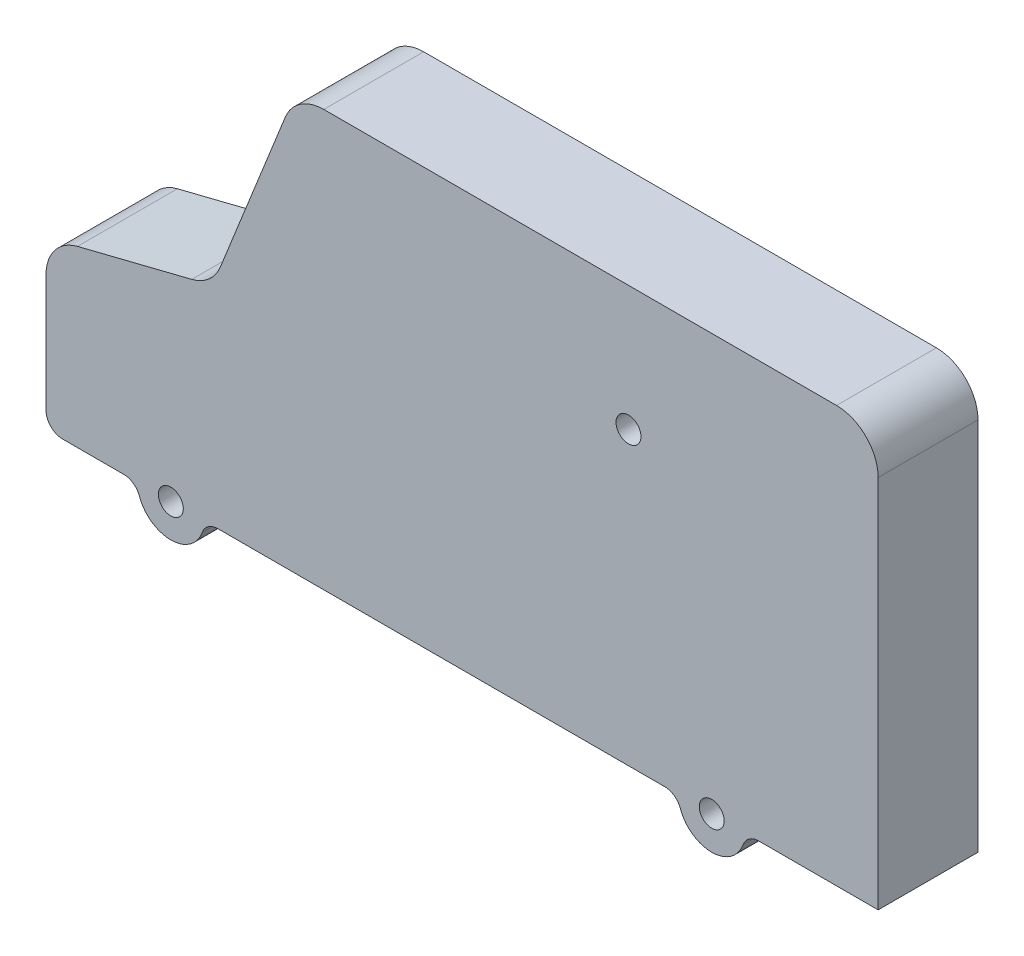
ISO-10303-21;
HEADER;
FILE_DESCRIPTION(('STEP AP214'),'2;1');
FILE_NAME('part.step','',(''),(''),'','','');
FILE_SCHEMA(('AUTOMOTIVE_DESIGN { 1 0 10303 214 1 1 1 1 }'));
ENDSEC;
DATA;
#1=APPLICATION_CONTEXT('core data for automotive mechanical design processes');
#2=APPLICATION_PROTOCOL_DEFINITION('international standard','automotive_design',2000,#1);
#3=PRODUCT_CONTEXT('',#1,'mechanical');
#4=PRODUCT('Part','Part','',(#3));
#5=PRODUCT_RELATED_PRODUCT_CATEGORY('part','',(#4));
#6=PRODUCT_DEFINITION_FORMATION('','',#4);
#7=PRODUCT_DEFINITION_CONTEXT('part definition',#1,'design');
#8=PRODUCT_DEFINITION('design','',#6,#7);
#9=PRODUCT_DEFINITION_SHAPE('','',#8);
#10=(LENGTH_UNIT() NAMED_UNIT(*) SI_UNIT(.MILLI.,.METRE.));
#11=(NAMED_UNIT(*) PLANE_ANGLE_UNIT() SI_UNIT($,.RADIAN.));
#12=(NAMED_UNIT(*) SI_UNIT($,.STERADIAN.) SOLID_ANGLE_UNIT());
#13=UNCERTAINTY_MEASURE_WITH_UNIT(LENGTH_MEASURE(1.E-05),#10,'distance_accuracy_value','');
#14=(GEOMETRIC_REPRESENTATION_CONTEXT(3) GLOBAL_UNCERTAINTY_ASSIGNED_CONTEXT((#13)) GLOBAL_UNIT_ASSIGNED_CONTEXT((#10,
#11,#12)) REPRESENTATION_CONTEXT('',''));
#15=CARTESIAN_POINT('',(0.,0.,0.));
#16=DIRECTION('',(0.,0.,1.));
#17=DIRECTION('',(1.,0.,0.));
#18=AXIS2_PLACEMENT_3D('',#15,#16,#17);
#19=CARTESIAN_POINT('',(33.3851648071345,45.,12.));
#20=DIRECTION('',(0.,0.,-1.));
#21=DIRECTION('',(-1.,0.,0.));
#22=AXIS2_PLACEMENT_3D('',#19,#20,#21);
#23=PLANE('',#22);
#24=CARTESIAN_POINT('',(80.,0.,12.));
#25=DIRECTION('',(0.,0.,1.));
#26=DIRECTION('',(1.,0.,0.));
#27=AXIS2_PLACEMENT_3D('',#24,#25,#26);
#28=CIRCLE('',#27,1.5);
#29=CARTESIAN_POINT('',(81.5,0.,12.));
#30=VERTEX_POINT('',#29);
#31=EDGE_CURVE('E421',#30,#30,#28,.T.);
#32=ORIENTED_EDGE('',*,*,#31,.F.);
#33=EDGE_LOOP('',(#32));
#34=FACE_BOUND('',#33,.T.);
#35=CARTESIAN_POINT('',(33.3851648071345,45.,12.));
#36=DIRECTION('',(0.,0.,1.));
#37=DIRECTION('',(-1.,0.,0.));
#38=AXIS2_PLACEMENT_3D('',#35,#36,#37);
#39=CIRCLE('',#38,5.);
#40=CARTESIAN_POINT('',(33.3851648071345,50.,12.));
#41=VERTEX_POINT('',#40);
#42=CARTESIAN_POINT('',(28.7427813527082,46.8569533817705,12.));
#43=VERTEX_POINT('',#42);
#44=EDGE_CURVE('E216',#41,#43,#39,.T.);
#45=ORIENTED_EDGE('',*,*,#44,.T.);
#46=DIRECTION('',(-0.371390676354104,-0.928476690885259,0.));
#47=VECTOR('',#46,1.);
#48=CARTESIAN_POINT('',(20.9494812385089,27.3737030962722,12.));
#49=LINE('',#48,#47);
#50=CARTESIAN_POINT('',(20.9494812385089,27.3737030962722,12.));
#51=VERTEX_POINT('',#50);
#52=EDGE_CURVE('E171',#43,#51,#49,.T.);
#53=ORIENTED_EDGE('',*,*,#52,.T.);
#54=CARTESIAN_POINT('',(16.3070977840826,29.2306564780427,12.));
#55=DIRECTION('',(0.,0.,-1.));
#56=DIRECTION('',(1.,0.,0.));
#57=AXIS2_PLACEMENT_3D('',#54,#55,#56);
#58=CIRCLE('',#57,5.);
#59=CARTESIAN_POINT('',(17.5197759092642,24.3799439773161,12.));
#60=VERTEX_POINT('',#59);
#61=EDGE_CURVE('E219',#51,#60,#58,.T.);
#62=ORIENTED_EDGE('',*,*,#61,.T.);
#63=DIRECTION('',(-0.970142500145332,-0.242535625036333,0.));
#64=VECTOR('',#63,1.);
#65=CARTESIAN_POINT('',(3.78732187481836,20.9468304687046,12.));
#66=LINE('',#65,#64);
#67=CARTESIAN_POINT('',(3.78732187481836,20.9468304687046,12.));
#68=VERTEX_POINT('',#67);
#69=EDGE_CURVE('E221',#60,#68,#66,.T.);
#70=ORIENTED_EDGE('',*,*,#69,.T.);
#71=CARTESIAN_POINT('',(5.,16.0961179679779,12.));
#72=DIRECTION('',(0.,0.,1.));
#73=DIRECTION('',(1.,0.,0.));
#74=AXIS2_PLACEMENT_3D('',#71,#72,#73);
#75=CIRCLE('',#74,5.);
#76=CARTESIAN_POINT('',(0.,16.0961179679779,12.));
#77=VERTEX_POINT('',#76);
#78=EDGE_CURVE('E223',#68,#77,#75,.T.);
#79=ORIENTED_EDGE('',*,*,#78,.T.);
#80=DIRECTION('',(0.,-1.,0.));
#81=VECTOR('',#80,1.);
#82=CARTESIAN_POINT('',(0.,2.00000000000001,12.));
#83=LINE('',#82,#81);
#84=CARTESIAN_POINT('',(0.,2.00000000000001,12.));
#85=VERTEX_POINT('',#84);
#86=EDGE_CURVE('E225',#77,#85,#83,.T.);
#87=ORIENTED_EDGE('',*,*,#86,.T.);
#88=CARTESIAN_POINT('',(2.,2.,12.));
#89=DIRECTION('',(0.,0.,1.));
#90=DIRECTION('',(-1.,0.,0.));
#91=AXIS2_PLACEMENT_3D('',#88,#89,#90);
#92=CIRCLE('',#91,2.);
#93=CARTESIAN_POINT('',(2.00000000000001,0.,12.));
#94=VERTEX_POINT('',#93);
#95=EDGE_CURVE('E227',#85,#94,#92,.T.);
#96=ORIENTED_EDGE('',*,*,#95,.T.);
#97=DIRECTION('',(1.,0.,0.));
#98=VECTOR('',#97,1.);
#99=CARTESIAN_POINT('',(2.00000000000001,0.,12.));
#100=LINE('',#99,#98);
#101=CARTESIAN_POINT('',(9.34314575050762,0.,12.));
#102=VERTEX_POINT('',#101);
#103=EDGE_CURVE('E229',#94,#102,#100,.T.);
#104=ORIENTED_EDGE('',*,*,#103,.T.);
#105=CARTESIAN_POINT('',(9.34314575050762,-2.,12.));
#106=DIRECTION('',(0.,0.,-1.));
#107=DIRECTION('',(1.,0.,0.));
#108=AXIS2_PLACEMENT_3D('',#105,#106,#107);
#109=CIRCLE('',#108,2.);
#110=CARTESIAN_POINT('',(11.2287638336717,-1.33333333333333,12.));
#111=VERTEX_POINT('',#110);
#112=EDGE_CURVE('E231',#102,#111,#109,.T.);
#113=ORIENTED_EDGE('',*,*,#112,.T.);
#114=CARTESIAN_POINT('',(15.,0.,12.));
#115=DIRECTION('',(0.,0.,1.));
#116=DIRECTION('',(1.,0.,0.));
#117=AXIS2_PLACEMENT_3D('',#114,#115,#116);
#118=CIRCLE('',#117,4.);
#119=CARTESIAN_POINT('',(18.7712361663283,-1.33333333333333,12.));
#120=VERTEX_POINT('',#119);
#121=EDGE_CURVE('E233',#111,#120,#118,.T.);
#122=ORIENTED_EDGE('',*,*,#121,.T.);
#123=CARTESIAN_POINT('',(20.6568542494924,-2.,12.));
#124=DIRECTION('',(0.,0.,-1.));
#125=DIRECTION('',(-1.,0.,0.));
#126=AXIS2_PLACEMENT_3D('',#123,#124,#125);
#127=CIRCLE('',#126,2.);
#128=CARTESIAN_POINT('',(20.6568542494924,0.,12.));
#129=VERTEX_POINT('',#128);
#130=EDGE_CURVE('E235',#120,#129,#127,.T.);
#131=ORIENTED_EDGE('',*,*,#130,.T.);
#132=DIRECTION('',(1.,0.,0.));
#133=VECTOR('',#132,1.);
#134=CARTESIAN_POINT('',(20.6568542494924,0.,12.));
#135=LINE('',#134,#133);
#136=CARTESIAN_POINT('',(74.3431457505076,0.,12.));
#137=VERTEX_POINT('',#136);
#138=EDGE_CURVE('E237',#129,#137,#135,.T.);
#139=ORIENTED_EDGE('',*,*,#138,.T.);
#140=CARTESIAN_POINT('',(74.3431457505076,-2.,12.));
#141=DIRECTION('',(0.,0.,-1.));
#142=DIRECTION('',(-1.,0.,0.));
#143=AXIS2_PLACEMENT_3D('',#140,#141,#142);
#144=CIRCLE('',#143,2.);
#145=CARTESIAN_POINT('',(76.2287638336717,-1.33333333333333,12.));
#146=VERTEX_POINT('',#145);
#147=EDGE_CURVE('E239',#137,#146,#144,.T.);
#148=ORIENTED_EDGE('',*,*,#147,.T.);
#149=CARTESIAN_POINT('',(80.,0.,12.));
#150=DIRECTION('',(0.,0.,1.));
#151=DIRECTION('',(1.,0.,0.));
#152=AXIS2_PLACEMENT_3D('',#149,#150,#151);
#153=CIRCLE('',#152,4.);
#154=CARTESIAN_POINT('',(83.7712361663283,-1.33333333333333,12.));
#155=VERTEX_POINT('',#154);
#156=EDGE_CURVE('E241',#146,#155,#153,.T.);
#157=ORIENTED_EDGE('',*,*,#156,.T.);
#158=CARTESIAN_POINT('',(85.6568542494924,-2.,12.));
#159=DIRECTION('',(0.,0.,-1.));
#160=DIRECTION('',(1.,0.,0.));
#161=AXIS2_PLACEMENT_3D('',#158,#159,#160);
#162=CIRCLE('',#161,2.);
#163=CARTESIAN_POINT('',(85.6568542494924,0.,12.));
#164=VERTEX_POINT('',#163);
#165=EDGE_CURVE('E243',#155,#164,#162,.T.);
#166=ORIENTED_EDGE('',*,*,#165,.T.);
#167=DIRECTION('',(1.,0.,0.));
#168=VECTOR('',#167,1.);
#169=CARTESIAN_POINT('',(85.6568542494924,0.,12.));
#170=LINE('',#169,#168);
#171=CARTESIAN_POINT('',(100.,0.,12.));
#172=VERTEX_POINT('',#171);
#173=EDGE_CURVE('E245',#164,#172,#170,.T.);
#174=ORIENTED_EDGE('',*,*,#173,.T.);
#175=DIRECTION('',(0.,1.,0.));
#176=VECTOR('',#175,1.);
#177=CARTESIAN_POINT('',(100.,0.,12.));
#178=LINE('',#177,#176);
#179=CARTESIAN_POINT('',(100.,45.,12.));
#180=VERTEX_POINT('',#179);
#181=EDGE_CURVE('E247',#172,#180,#178,.T.);
#182=ORIENTED_EDGE('',*,*,#181,.T.);
#183=CARTESIAN_POINT('',(95.,45.,12.));
#184=DIRECTION('',(0.,0.,1.));
#185=DIRECTION('',(-1.,0.,0.));
#186=AXIS2_PLACEMENT_3D('',#183,#184,#185);
#187=CIRCLE('',#186,5.);
#188=CARTESIAN_POINT('',(95.,50.,12.));
#189=VERTEX_POINT('',#188);
#190=EDGE_CURVE('E46',#180,#189,#187,.T.);
#191=ORIENTED_EDGE('',*,*,#190,.T.);
#192=DIRECTION('',(-1.,0.,0.));
#193=VECTOR('',#192,1.);
#194=CARTESIAN_POINT('',(33.3851648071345,50.,12.));
#195=LINE('',#194,#193);
#196=EDGE_CURVE('E41',#189,#41,#195,.T.);
#197=ORIENTED_EDGE('',*,*,#196,.T.);
#198=EDGE_LOOP('',(#45,#53,#62,#70,#79,#87,#96,#104,#113,#122,#131,#139,#148,#157,#166,#174,
#182,#191,#197));
#199=FACE_BOUND('',#198,.T.);
#200=CARTESIAN_POINT('',(15.,0.,12.));
#201=DIRECTION('',(0.,0.,1.));
#202=DIRECTION('',(1.,0.,0.));
#203=AXIS2_PLACEMENT_3D('',#200,#201,#202);
#204=CIRCLE('',#203,1.5);
#205=CARTESIAN_POINT('',(16.5,0.,12.));
#206=VERTEX_POINT('',#205);
#207=EDGE_CURVE('E176',#206,#206,#204,.T.);
#208=ORIENTED_EDGE('',*,*,#207,.F.);
#209=EDGE_LOOP('',(#208));
#210=FACE_BOUND('',#209,.T.);
#211=CARTESIAN_POINT('',(70.,35.,12.));
#212=DIRECTION('',(0.,0.,1.));
#213=DIRECTION('',(1.,0.,0.));
#214=AXIS2_PLACEMENT_3D('',#211,#212,#213);
#215=CIRCLE('',#214,1.5);
#216=CARTESIAN_POINT('',(71.5,35.,12.));
#217=VERTEX_POINT('',#216);
#218=EDGE_CURVE('E410',#217,#217,#215,.T.);
#219=ORIENTED_EDGE('',*,*,#218,.F.);
#220=EDGE_LOOP('',(#219));
#221=FACE_BOUND('',#220,.T.);
#222=ADVANCED_FACE('F26',(#34,#199,#210,#221),#23,.F.);
#223=CARTESIAN_POINT('',(33.3851648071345,45.,0.));
#224=DIRECTION('',(0.,0.,-1.));
#225=DIRECTION('',(-1.,0.,0.));
#226=AXIS2_PLACEMENT_3D('',#223,#224,#225);
#227=PLANE('',#226);
#228=CARTESIAN_POINT('',(80.,0.,0.));
#229=DIRECTION('',(0.,0.,1.));
#230=DIRECTION('',(1.,0.,0.));
#231=AXIS2_PLACEMENT_3D('',#228,#229,#230);
#232=CIRCLE('',#231,1.5);
#233=CARTESIAN_POINT('',(81.5,0.,0.));
#234=VERTEX_POINT('',#233);
#235=EDGE_CURVE('E416',#234,#234,#232,.T.);
#236=ORIENTED_EDGE('',*,*,#235,.T.);
#237=EDGE_LOOP('',(#236));
#238=FACE_BOUND('',#237,.T.);
#239=CARTESIAN_POINT('',(33.3851648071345,45.,0.));
#240=DIRECTION('',(0.,0.,1.));
#241=DIRECTION('',(-1.,0.,0.));
#242=AXIS2_PLACEMENT_3D('',#239,#240,#241);
#243=CIRCLE('',#242,5.);
#244=CARTESIAN_POINT('',(33.3851648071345,50.,0.));
#245=VERTEX_POINT('',#244);
#246=CARTESIAN_POINT('',(28.7427813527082,46.8569533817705,0.));
#247=VERTEX_POINT('',#246);
#248=EDGE_CURVE('E162',#245,#247,#243,.T.);
#249=ORIENTED_EDGE('',*,*,#248,.F.);
#250=DIRECTION('',(-1.,0.,0.));
#251=VECTOR('',#250,1.);
#252=CARTESIAN_POINT('',(33.3851648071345,50.,0.));
#253=LINE('',#252,#251);
#254=CARTESIAN_POINT('',(95.,50.,0.));
#255=VERTEX_POINT('',#254);
#256=EDGE_CURVE('E214',#255,#245,#253,.T.);
#257=ORIENTED_EDGE('',*,*,#256,.F.);
#258=CARTESIAN_POINT('',(95.,45.,0.));
#259=DIRECTION('',(0.,0.,1.));
#260=DIRECTION('',(-1.,0.,0.));
#261=AXIS2_PLACEMENT_3D('',#258,#259,#260);
#262=CIRCLE('',#261,5.);
#263=CARTESIAN_POINT('',(100.,45.,0.));
#264=VERTEX_POINT('',#263);
#265=EDGE_CURVE('E212',#264,#255,#262,.T.);
#266=ORIENTED_EDGE('',*,*,#265,.F.);
#267=DIRECTION('',(0.,1.,0.));
#268=VECTOR('',#267,1.);
#269=CARTESIAN_POINT('',(100.,0.,0.));
#270=LINE('',#269,#268);
#271=CARTESIAN_POINT('',(100.,0.,0.));
#272=VERTEX_POINT('',#271);
#273=EDGE_CURVE('E210',#272,#264,#270,.T.);
#274=ORIENTED_EDGE('',*,*,#273,.F.);
#275=DIRECTION('',(1.,0.,0.));
#276=VECTOR('',#275,1.);
#277=CARTESIAN_POINT('',(85.6568542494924,0.,0.));
#278=LINE('',#277,#276);
#279=CARTESIAN_POINT('',(85.6568542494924,0.,0.));
#280=VERTEX_POINT('',#279);
#281=EDGE_CURVE('E208',#280,#272,#278,.T.);
#282=ORIENTED_EDGE('',*,*,#281,.F.);
#283=CARTESIAN_POINT('',(85.6568542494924,-2.,0.));
#284=DIRECTION('',(0.,0.,-1.));
#285=DIRECTION('',(1.,0.,0.));
#286=AXIS2_PLACEMENT_3D('',#283,#284,#285);
#287=CIRCLE('',#286,2.);
#288=CARTESIAN_POINT('',(83.7712361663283,-1.33333333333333,0.));
#289=VERTEX_POINT('',#288);
#290=EDGE_CURVE('E206',#289,#280,#287,.T.);
#291=ORIENTED_EDGE('',*,*,#290,.F.);
#292=CARTESIAN_POINT('',(80.,0.,0.));
#293=DIRECTION('',(0.,0.,1.));
#294=DIRECTION('',(1.,0.,0.));
#295=AXIS2_PLACEMENT_3D('',#292,#293,#294);
#296=CIRCLE('',#295,4.);
#297=CARTESIAN_POINT('',(76.2287638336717,-1.33333333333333,0.));
#298=VERTEX_POINT('',#297);
#299=EDGE_CURVE('E204',#298,#289,#296,.T.);
#300=ORIENTED_EDGE('',*,*,#299,.F.);
#301=CARTESIAN_POINT('',(74.3431457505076,-2.,0.));
#302=DIRECTION('',(0.,0.,-1.));
#303=DIRECTION('',(-1.,0.,0.));
#304=AXIS2_PLACEMENT_3D('',#301,#302,#303);
#305=CIRCLE('',#304,2.);
#306=CARTESIAN_POINT('',(74.3431457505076,0.,0.));
#307=VERTEX_POINT('',#306);
#308=EDGE_CURVE('E202',#307,#298,#305,.T.);
#309=ORIENTED_EDGE('',*,*,#308,.F.);
#310=DIRECTION('',(1.,0.,0.));
#311=VECTOR('',#310,1.);
#312=CARTESIAN_POINT('',(20.6568542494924,0.,0.));
#313=LINE('',#312,#311);
#314=CARTESIAN_POINT('',(20.6568542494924,0.,0.));
#315=VERTEX_POINT('',#314);
#316=EDGE_CURVE('E200',#315,#307,#313,.T.);
#317=ORIENTED_EDGE('',*,*,#316,.F.);
#318=CARTESIAN_POINT('',(20.6568542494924,-2.,0.));
#319=DIRECTION('',(0.,0.,-1.));
#320=DIRECTION('',(-1.,0.,0.));
#321=AXIS2_PLACEMENT_3D('',#318,#319,#320);
#322=CIRCLE('',#321,2.);
#323=CARTESIAN_POINT('',(18.7712361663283,-1.33333333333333,0.));
#324=VERTEX_POINT('',#323);
#325=EDGE_CURVE('E198',#324,#315,#322,.T.);
#326=ORIENTED_EDGE('',*,*,#325,.F.);
#327=CARTESIAN_POINT('',(15.,0.,0.));
#328=DIRECTION('',(0.,0.,1.));
#329=DIRECTION('',(1.,0.,0.));
#330=AXIS2_PLACEMENT_3D('',#327,#328,#329);
#331=CIRCLE('',#330,4.);
#332=CARTESIAN_POINT('',(11.2287638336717,-1.33333333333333,0.));
#333=VERTEX_POINT('',#332);
#334=EDGE_CURVE('E196',#333,#324,#331,.T.);
#335=ORIENTED_EDGE('',*,*,#334,.F.);
#336=CARTESIAN_POINT('',(9.34314575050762,-2.,0.));
#337=DIRECTION('',(0.,0.,-1.));
#338=DIRECTION('',(1.,0.,0.));
#339=AXIS2_PLACEMENT_3D('',#336,#337,#338);
#340=CIRCLE('',#339,2.);
#341=CARTESIAN_POINT('',(9.34314575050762,0.,0.));
#342=VERTEX_POINT('',#341);
#343=EDGE_CURVE('E194',#342,#333,#340,.T.);
#344=ORIENTED_EDGE('',*,*,#343,.F.);
#345=DIRECTION('',(1.,0.,0.));
#346=VECTOR('',#345,1.);
#347=CARTESIAN_POINT('',(2.00000000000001,0.,0.));
#348=LINE('',#347,#346);
#349=CARTESIAN_POINT('',(2.00000000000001,0.,0.));
#350=VERTEX_POINT('',#349);
#351=EDGE_CURVE('E192',#350,#342,#348,.T.);
#352=ORIENTED_EDGE('',*,*,#351,.F.);
#353=CARTESIAN_POINT('',(2.,2.,0.));
#354=DIRECTION('',(0.,0.,1.));
#355=DIRECTION('',(-1.,0.,0.));
#356=AXIS2_PLACEMENT_3D('',#353,#354,#355);
#357=CIRCLE('',#356,2.);
#358=CARTESIAN_POINT('',(0.,2.00000000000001,0.));
#359=VERTEX_POINT('',#358);
#360=EDGE_CURVE('E190',#359,#350,#357,.T.);
#361=ORIENTED_EDGE('',*,*,#360,.F.);
#362=DIRECTION('',(0.,-1.,0.));
#363=VECTOR('',#362,1.);
#364=CARTESIAN_POINT('',(0.,2.00000000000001,0.));
#365=LINE('',#364,#363);
#366=CARTESIAN_POINT('',(0.,16.0961179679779,0.));
#367=VERTEX_POINT('',#366);
#368=EDGE_CURVE('E188',#367,#359,#365,.T.);
#369=ORIENTED_EDGE('',*,*,#368,.F.);
#370=CARTESIAN_POINT('',(5.,16.0961179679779,0.));
#371=DIRECTION('',(0.,0.,1.));
#372=DIRECTION('',(1.,0.,0.));
#373=AXIS2_PLACEMENT_3D('',#370,#371,#372);
#374=CIRCLE('',#373,5.);
#375=CARTESIAN_POINT('',(3.78732187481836,20.9468304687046,0.));
#376=VERTEX_POINT('',#375);
#377=EDGE_CURVE('E186',#376,#367,#374,.T.);
#378=ORIENTED_EDGE('',*,*,#377,.F.);
#379=DIRECTION('',(-0.970142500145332,-0.242535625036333,0.));
#380=VECTOR('',#379,1.);
#381=CARTESIAN_POINT('',(3.78732187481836,20.9468304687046,0.));
#382=LINE('',#381,#380);
#383=CARTESIAN_POINT('',(17.5197759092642,24.3799439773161,0.));
#384=VERTEX_POINT('',#383);
#385=EDGE_CURVE('E184',#384,#376,#382,.T.);
#386=ORIENTED_EDGE('',*,*,#385,.F.);
#387=CARTESIAN_POINT('',(16.3070977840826,29.2306564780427,0.));
#388=DIRECTION('',(0.,0.,-1.));
#389=DIRECTION('',(1.,0.,0.));
#390=AXIS2_PLACEMENT_3D('',#387,#388,#389);
#391=CIRCLE('',#390,5.);
#392=CARTESIAN_POINT('',(20.9494812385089,27.3737030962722,0.));
#393=VERTEX_POINT('',#392);
#394=EDGE_CURVE('E164',#393,#384,#391,.T.);
#395=ORIENTED_EDGE('',*,*,#394,.F.);
#396=DIRECTION('',(-0.371390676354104,-0.928476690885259,0.));
#397=VECTOR('',#396,1.);
#398=CARTESIAN_POINT('',(20.9494812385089,27.3737030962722,0.));
#399=LINE('',#398,#397);
#400=EDGE_CURVE('E157',#247,#393,#399,.T.);
#401=ORIENTED_EDGE('',*,*,#400,.F.);
#402=EDGE_LOOP('',(#249,#257,#266,#274,#282,#291,#300,#309,#317,#326,#335,#344,#352,#361,#369,
#378,#386,#395,#401));
#403=FACE_BOUND('',#402,.T.);
#404=CARTESIAN_POINT('',(15.,0.,0.));
#405=DIRECTION('',(0.,0.,1.));
#406=DIRECTION('',(1.,0.,0.));
#407=AXIS2_PLACEMENT_3D('',#404,#405,#406);
#408=CIRCLE('',#407,1.5);
#409=CARTESIAN_POINT('',(16.5,0.,0.));
#410=VERTEX_POINT('',#409);
#411=EDGE_CURVE('E179',#410,#410,#408,.T.);
#412=ORIENTED_EDGE('',*,*,#411,.T.);
#413=EDGE_LOOP('',(#412));
#414=FACE_BOUND('',#413,.T.);
#415=CARTESIAN_POINT('',(70.,35.,0.));
#416=DIRECTION('',(0.,0.,1.));
#417=DIRECTION('',(1.,0.,0.));
#418=AXIS2_PLACEMENT_3D('',#415,#416,#417);
#419=CIRCLE('',#418,1.5);
#420=CARTESIAN_POINT('',(71.5,35.,0.));
#421=VERTEX_POINT('',#420);
#422=EDGE_CURVE('E413',#421,#421,#419,.T.);
#423=ORIENTED_EDGE('',*,*,#422,.T.);
#424=EDGE_LOOP('',(#423));
#425=FACE_BOUND('',#424,.T.);
#426=ADVANCED_FACE('F158',(#238,#403,#414,#425),#227,.T.);
#427=CARTESIAN_POINT('',(33.3851648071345,45.,12.));
#428=DIRECTION('',(0.,0.,-1.));
#429=DIRECTION('',(-1.,0.,0.));
#430=AXIS2_PLACEMENT_3D('',#427,#428,#429);
#431=CYLINDRICAL_SURFACE('',#430,5.);
#432=ORIENTED_EDGE('',*,*,#248,.T.);
#433=DIRECTION('',(0.,0.,-1.));
#434=VECTOR('',#433,1.);
#435=CARTESIAN_POINT('',(28.7427813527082,46.8569533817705,12.));
#436=LINE('',#435,#434);
#437=EDGE_CURVE('E11',#43,#247,#436,.T.);
#438=ORIENTED_EDGE('',*,*,#437,.F.);
#439=ORIENTED_EDGE('',*,*,#44,.F.);
#440=DIRECTION('',(0.,0.,-1.));
#441=VECTOR('',#440,1.);
#442=CARTESIAN_POINT('',(33.3851648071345,50.,12.));
#443=LINE('',#442,#441);
#444=EDGE_CURVE('E175',#41,#245,#443,.T.);
#445=ORIENTED_EDGE('',*,*,#444,.T.);
#446=EDGE_LOOP('',(#432,#438,#439,#445));
#447=FACE_BOUND('',#446,.T.);
#448=ADVANCED_FACE('F28',(#447),#431,.T.);
#449=CARTESIAN_POINT('',(20.9494812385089,27.3737030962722,12.));
#450=DIRECTION('',(0.928476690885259,-0.371390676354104,0.));
#451=DIRECTION('',(0.371390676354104,0.928476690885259,0.));
#452=AXIS2_PLACEMENT_3D('',#449,#450,#451);
#453=PLANE('',#452);
#454=ORIENTED_EDGE('',*,*,#400,.T.);
#455=DIRECTION('',(0.,0.,-1.));
#456=VECTOR('',#455,1.);
#457=CARTESIAN_POINT('',(20.9494812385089,27.3737030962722,12.));
#458=LINE('',#457,#456);
#459=EDGE_CURVE('E34',#51,#393,#458,.T.);
#460=ORIENTED_EDGE('',*,*,#459,.F.);
#461=ORIENTED_EDGE('',*,*,#52,.F.);
#462=ORIENTED_EDGE('',*,*,#437,.T.);
#463=EDGE_LOOP('',(#454,#460,#461,#462));
#464=FACE_BOUND('',#463,.T.);
#465=ADVANCED_FACE('F170',(#464),#453,.F.);
#466=CARTESIAN_POINT('',(16.3070977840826,29.2306564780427,12.));
#467=DIRECTION('',(0.,0.,-1.));
#468=DIRECTION('',(-1.,0.,0.));
#469=AXIS2_PLACEMENT_3D('',#466,#467,#468);
#470=CYLINDRICAL_SURFACE('',#469,5.);
#471=ORIENTED_EDGE('',*,*,#394,.T.);
#472=DIRECTION('',(0.,0.,-1.));
#473=VECTOR('',#472,1.);
#474=CARTESIAN_POINT('',(17.5197759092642,24.3799439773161,12.));
#475=LINE('',#474,#473);
#476=EDGE_CURVE('E297',#60,#384,#475,.T.);
#477=ORIENTED_EDGE('',*,*,#476,.F.);
#478=ORIENTED_EDGE('',*,*,#61,.F.);
#479=ORIENTED_EDGE('',*,*,#459,.T.);
#480=EDGE_LOOP('',(#471,#477,#478,#479));
#481=FACE_BOUND('',#480,.T.);
#482=ADVANCED_FACE('F301',(#481),#470,.F.);
#483=CARTESIAN_POINT('',(3.78732187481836,20.9468304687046,12.));
#484=DIRECTION('',(0.242535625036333,-0.970142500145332,0.));
#485=DIRECTION('',(0.970142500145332,0.242535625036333,0.));
#486=AXIS2_PLACEMENT_3D('',#483,#484,#485);
#487=PLANE('',#486);
#488=ORIENTED_EDGE('',*,*,#385,.T.);
#489=DIRECTION('',(0.,0.,-1.));
#490=VECTOR('',#489,1.);
#491=CARTESIAN_POINT('',(3.78732187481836,20.9468304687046,12.));
#492=LINE('',#491,#490);
#493=EDGE_CURVE('E294',#68,#376,#492,.T.);
#494=ORIENTED_EDGE('',*,*,#493,.F.);
#495=ORIENTED_EDGE('',*,*,#69,.F.);
#496=ORIENTED_EDGE('',*,*,#476,.T.);
#497=EDGE_LOOP('',(#488,#494,#495,#496));
#498=FACE_BOUND('',#497,.T.);
#499=ADVANCED_FACE('F309',(#498),#487,.F.);
#500=CARTESIAN_POINT('',(5.,16.0961179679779,12.));
#501=DIRECTION('',(0.,0.,-1.));
#502=DIRECTION('',(-1.,0.,0.));
#503=AXIS2_PLACEMENT_3D('',#500,#501,#502);
#504=CYLINDRICAL_SURFACE('',#503,5.);
#505=ORIENTED_EDGE('',*,*,#377,.T.);
#506=DIRECTION('',(0.,0.,-1.));
#507=VECTOR('',#506,1.);
#508=CARTESIAN_POINT('',(0.,16.0961179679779,12.));
#509=LINE('',#508,#507);
#510=EDGE_CURVE('E291',#77,#367,#509,.T.);
#511=ORIENTED_EDGE('',*,*,#510,.F.);
#512=ORIENTED_EDGE('',*,*,#78,.F.);
#513=ORIENTED_EDGE('',*,*,#493,.T.);
#514=EDGE_LOOP('',(#505,#511,#512,#513));
#515=FACE_BOUND('',#514,.T.);
#516=ADVANCED_FACE('F312',(#515),#504,.T.);
#517=CARTESIAN_POINT('',(0.,2.00000000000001,12.));
#518=DIRECTION('',(1.,0.,0.));
#519=DIRECTION('',(0.,0.,-1.));
#520=AXIS2_PLACEMENT_3D('',#517,#518,#519);
#521=PLANE('',#520);
#522=ORIENTED_EDGE('',*,*,#368,.T.);
#523=DIRECTION('',(0.,0.,-1.));
#524=VECTOR('',#523,1.);
#525=CARTESIAN_POINT('',(0.,2.00000000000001,12.));
#526=LINE('',#525,#524);
#527=EDGE_CURVE('E288',#85,#359,#526,.T.);
#528=ORIENTED_EDGE('',*,*,#527,.F.);
#529=ORIENTED_EDGE('',*,*,#86,.F.);
#530=ORIENTED_EDGE('',*,*,#510,.T.);
#531=EDGE_LOOP('',(#522,#528,#529,#530));
#532=FACE_BOUND('',#531,.T.);
#533=ADVANCED_FACE('F317',(#532),#521,.F.);
#534=CARTESIAN_POINT('',(2.,2.,12.));
#535=DIRECTION('',(0.,0.,-1.));
#536=DIRECTION('',(-1.,0.,0.));
#537=AXIS2_PLACEMENT_3D('',#534,#535,#536);
#538=CYLINDRICAL_SURFACE('',#537,2.);
#539=ORIENTED_EDGE('',*,*,#360,.T.);
#540=DIRECTION('',(0.,0.,-1.));
#541=VECTOR('',#540,1.);
#542=CARTESIAN_POINT('',(2.00000000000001,0.,12.));
#543=LINE('',#542,#541);
#544=EDGE_CURVE('E285',#94,#350,#543,.T.);
#545=ORIENTED_EDGE('',*,*,#544,.F.);
#546=ORIENTED_EDGE('',*,*,#95,.F.);
#547=ORIENTED_EDGE('',*,*,#527,.T.);
#548=EDGE_LOOP('',(#539,#545,#546,#547));
#549=FACE_BOUND('',#548,.T.);
#550=ADVANCED_FACE('F323',(#549),#538,.T.);
#551=CARTESIAN_POINT('',(2.00000000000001,0.,12.));
#552=DIRECTION('',(0.,1.,0.));
#553=DIRECTION('',(0.,0.,1.));
#554=AXIS2_PLACEMENT_3D('',#551,#552,#553);
#555=PLANE('',#554);
#556=ORIENTED_EDGE('',*,*,#351,.T.);
#557=DIRECTION('',(0.,0.,-1.));
#558=VECTOR('',#557,1.);
#559=CARTESIAN_POINT('',(9.34314575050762,0.,12.));
#560=LINE('',#559,#558);
#561=EDGE_CURVE('E282',#102,#342,#560,.T.);
#562=ORIENTED_EDGE('',*,*,#561,.F.);
#563=ORIENTED_EDGE('',*,*,#103,.F.);
#564=ORIENTED_EDGE('',*,*,#544,.T.);
#565=EDGE_LOOP('',(#556,#562,#563,#564));
#566=FACE_BOUND('',#565,.T.);
#567=ADVANCED_FACE('F327',(#566),#555,.F.);
#568=CARTESIAN_POINT('',(9.34314575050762,-2.,12.));
#569=DIRECTION('',(0.,0.,-1.));
#570=DIRECTION('',(-1.,0.,0.));
#571=AXIS2_PLACEMENT_3D('',#568,#569,#570);
#572=CYLINDRICAL_SURFACE('',#571,2.);
#573=ORIENTED_EDGE('',*,*,#343,.T.);
#574=DIRECTION('',(0.,0.,-1.));
#575=VECTOR('',#574,1.);
#576=CARTESIAN_POINT('',(11.2287638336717,-1.33333333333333,12.));
#577=LINE('',#576,#575);
#578=EDGE_CURVE('E279',#111,#333,#577,.T.);
#579=ORIENTED_EDGE('',*,*,#578,.F.);
#580=ORIENTED_EDGE('',*,*,#112,.F.);
#581=ORIENTED_EDGE('',*,*,#561,.T.);
#582=EDGE_LOOP('',(#573,#579,#580,#581));
#583=FACE_BOUND('',#582,.T.);
#584=ADVANCED_FACE('F332',(#583),#572,.F.);
#585=CARTESIAN_POINT('',(15.,0.,12.));
#586=DIRECTION('',(0.,0.,-1.));
#587=DIRECTION('',(-1.,0.,0.));
#588=AXIS2_PLACEMENT_3D('',#585,#586,#587);
#589=CYLINDRICAL_SURFACE('',#588,4.);
#590=ORIENTED_EDGE('',*,*,#334,.T.);
#591=DIRECTION('',(0.,0.,-1.));
#592=VECTOR('',#591,1.);
#593=CARTESIAN_POINT('',(18.7712361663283,-1.33333333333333,12.));
#594=LINE('',#593,#592);
#595=EDGE_CURVE('E276',#120,#324,#594,.T.);
#596=ORIENTED_EDGE('',*,*,#595,.F.);
#597=ORIENTED_EDGE('',*,*,#121,.F.);
#598=ORIENTED_EDGE('',*,*,#578,.T.);
#599=EDGE_LOOP('',(#590,#596,#597,#598));
#600=FACE_BOUND('',#599,.T.);
#601=ADVANCED_FACE('F338',(#600),#589,.T.);
#602=CARTESIAN_POINT('',(20.6568542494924,-2.,12.));
#603=DIRECTION('',(0.,0.,-1.));
#604=DIRECTION('',(-1.,0.,0.));
#605=AXIS2_PLACEMENT_3D('',#602,#603,#604);
#606=CYLINDRICAL_SURFACE('',#605,2.);
#607=ORIENTED_EDGE('',*,*,#325,.T.);
#608=DIRECTION('',(0.,0.,-1.));
#609=VECTOR('',#608,1.);
#610=CARTESIAN_POINT('',(20.6568542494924,0.,12.));
#611=LINE('',#610,#609);
#612=EDGE_CURVE('E273',#129,#315,#611,.T.);
#613=ORIENTED_EDGE('',*,*,#612,.F.);
#614=ORIENTED_EDGE('',*,*,#130,.F.);
#615=ORIENTED_EDGE('',*,*,#595,.T.);
#616=EDGE_LOOP('',(#607,#613,#614,#615));
#617=FACE_BOUND('',#616,.T.);
#618=ADVANCED_FACE('F342',(#617),#606,.F.);
#619=CARTESIAN_POINT('',(20.6568542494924,0.,12.));
#620=DIRECTION('',(0.,1.,0.));
#621=DIRECTION('',(0.,0.,1.));
#622=AXIS2_PLACEMENT_3D('',#619,#620,#621);
#623=PLANE('',#622);
#624=ORIENTED_EDGE('',*,*,#316,.T.);
#625=DIRECTION('',(0.,0.,-1.));
#626=VECTOR('',#625,1.);
#627=CARTESIAN_POINT('',(74.3431457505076,0.,12.));
#628=LINE('',#627,#626);
#629=EDGE_CURVE('E270',#137,#307,#628,.T.);
#630=ORIENTED_EDGE('',*,*,#629,.F.);
#631=ORIENTED_EDGE('',*,*,#138,.F.);
#632=ORIENTED_EDGE('',*,*,#612,.T.);
#633=EDGE_LOOP('',(#624,#630,#631,#632));
#634=FACE_BOUND('',#633,.T.);
#635=ADVANCED_FACE('F347',(#634),#623,.F.);
#636=CARTESIAN_POINT('',(74.3431457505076,-2.,12.));
#637=DIRECTION('',(0.,0.,-1.));
#638=DIRECTION('',(-1.,0.,0.));
#639=AXIS2_PLACEMENT_3D('',#636,#637,#638);
#640=CYLINDRICAL_SURFACE('',#639,2.);
#641=ORIENTED_EDGE('',*,*,#308,.T.);
#642=DIRECTION('',(0.,0.,-1.));
#643=VECTOR('',#642,1.);
#644=CARTESIAN_POINT('',(76.2287638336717,-1.33333333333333,12.));
#645=LINE('',#644,#643);
#646=EDGE_CURVE('E267',#146,#298,#645,.T.);
#647=ORIENTED_EDGE('',*,*,#646,.F.);
#648=ORIENTED_EDGE('',*,*,#147,.F.);
#649=ORIENTED_EDGE('',*,*,#629,.T.);
#650=EDGE_LOOP('',(#641,#647,#648,#649));
#651=FACE_BOUND('',#650,.T.);
#652=ADVANCED_FACE('F353',(#651),#640,.F.);
#653=CARTESIAN_POINT('',(80.,0.,12.));
#654=DIRECTION('',(0.,0.,-1.));
#655=DIRECTION('',(-1.,0.,0.));
#656=AXIS2_PLACEMENT_3D('',#653,#654,#655);
#657=CYLINDRICAL_SURFACE('',#656,4.);
#658=ORIENTED_EDGE('',*,*,#299,.T.);
#659=DIRECTION('',(0.,0.,-1.));
#660=VECTOR('',#659,1.);
#661=CARTESIAN_POINT('',(83.7712361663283,-1.33333333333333,12.));
#662=LINE('',#661,#660);
#663=EDGE_CURVE('E264',#155,#289,#662,.T.);
#664=ORIENTED_EDGE('',*,*,#663,.F.);
#665=ORIENTED_EDGE('',*,*,#156,.F.);
#666=ORIENTED_EDGE('',*,*,#646,.T.);
#667=EDGE_LOOP('',(#658,#664,#665,#666));
#668=FACE_BOUND('',#667,.T.);
#669=ADVANCED_FACE('F357',(#668),#657,.T.);
#670=CARTESIAN_POINT('',(85.6568542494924,-2.,12.));
#671=DIRECTION('',(0.,0.,-1.));
#672=DIRECTION('',(-1.,0.,0.));
#673=AXIS2_PLACEMENT_3D('',#670,#671,#672);
#674=CYLINDRICAL_SURFACE('',#673,2.);
#675=ORIENTED_EDGE('',*,*,#290,.T.);
#676=DIRECTION('',(0.,0.,-1.));
#677=VECTOR('',#676,1.);
#678=CARTESIAN_POINT('',(85.6568542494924,0.,12.));
#679=LINE('',#678,#677);
#680=EDGE_CURVE('E261',#164,#280,#679,.T.);
#681=ORIENTED_EDGE('',*,*,#680,.F.);
#682=ORIENTED_EDGE('',*,*,#165,.F.);
#683=ORIENTED_EDGE('',*,*,#663,.T.);
#684=EDGE_LOOP('',(#675,#681,#682,#683));
#685=FACE_BOUND('',#684,.T.);
#686=ADVANCED_FACE('F362',(#685),#674,.F.);
#687=CARTESIAN_POINT('',(85.6568542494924,0.,12.));
#688=DIRECTION('',(0.,1.,0.));
#689=DIRECTION('',(0.,0.,1.));
#690=AXIS2_PLACEMENT_3D('',#687,#688,#689);
#691=PLANE('',#690);
#692=ORIENTED_EDGE('',*,*,#281,.T.);
#693=DIRECTION('',(0.,0.,-1.));
#694=VECTOR('',#693,1.);
#695=CARTESIAN_POINT('',(100.,0.,12.));
#696=LINE('',#695,#694);
#697=EDGE_CURVE('E258',#172,#272,#696,.T.);
#698=ORIENTED_EDGE('',*,*,#697,.F.);
#699=ORIENTED_EDGE('',*,*,#173,.F.);
#700=ORIENTED_EDGE('',*,*,#680,.T.);
#701=EDGE_LOOP('',(#692,#698,#699,#700));
#702=FACE_BOUND('',#701,.T.);
#703=ADVANCED_FACE('F368',(#702),#691,.F.);
#704=CARTESIAN_POINT('',(100.,0.,12.));
#705=DIRECTION('',(-1.,0.,0.));
#706=DIRECTION('',(0.,0.,1.));
#707=AXIS2_PLACEMENT_3D('',#704,#705,#706);
#708=PLANE('',#707);
#709=ORIENTED_EDGE('',*,*,#273,.T.);
#710=DIRECTION('',(0.,0.,-1.));
#711=VECTOR('',#710,1.);
#712=CARTESIAN_POINT('',(100.,45.,12.));
#713=LINE('',#712,#711);
#714=EDGE_CURVE('E255',#180,#264,#713,.T.);
#715=ORIENTED_EDGE('',*,*,#714,.F.);
#716=ORIENTED_EDGE('',*,*,#181,.F.);
#717=ORIENTED_EDGE('',*,*,#697,.T.);
#718=EDGE_LOOP('',(#709,#715,#716,#717));
#719=FACE_BOUND('',#718,.T.);
#720=ADVANCED_FACE('F372',(#719),#708,.F.);
#721=CARTESIAN_POINT('',(95.,45.,12.));
#722=DIRECTION('',(0.,0.,-1.));
#723=DIRECTION('',(-1.,0.,0.));
#724=AXIS2_PLACEMENT_3D('',#721,#722,#723);
#725=CYLINDRICAL_SURFACE('',#724,5.);
#726=ORIENTED_EDGE('',*,*,#265,.T.);
#727=DIRECTION('',(0.,0.,-1.));
#728=VECTOR('',#727,1.);
#729=CARTESIAN_POINT('',(95.,50.,12.));
#730=LINE('',#729,#728);
#731=EDGE_CURVE('E252',#189,#255,#730,.T.);
#732=ORIENTED_EDGE('',*,*,#731,.F.);
#733=ORIENTED_EDGE('',*,*,#190,.F.);
#734=ORIENTED_EDGE('',*,*,#714,.T.);
#735=EDGE_LOOP('',(#726,#732,#733,#734));
#736=FACE_BOUND('',#735,.T.);
#737=ADVANCED_FACE('F375',(#736),#725,.T.);
#738=CARTESIAN_POINT('',(33.3851648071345,50.,12.));
#739=DIRECTION('',(0.,-1.,0.));
#740=DIRECTION('',(0.,0.,-1.));
#741=AXIS2_PLACEMENT_3D('',#738,#739,#740);
#742=PLANE('',#741);
#743=ORIENTED_EDGE('',*,*,#256,.T.);
#744=ORIENTED_EDGE('',*,*,#444,.F.);
#745=ORIENTED_EDGE('',*,*,#196,.F.);
#746=ORIENTED_EDGE('',*,*,#731,.T.);
#747=EDGE_LOOP('',(#743,#744,#745,#746));
#748=FACE_BOUND('',#747,.T.);
#749=ADVANCED_FACE('F377',(#748),#742,.F.);
#750=CARTESIAN_POINT('',(15.,0.,12.));
#751=DIRECTION('',(0.,0.,-1.));
#752=DIRECTION('',(-1.,0.,0.));
#753=AXIS2_PLACEMENT_3D('',#750,#751,#752);
#754=CYLINDRICAL_SURFACE('',#753,1.5);
#755=ORIENTED_EDGE('',*,*,#207,.T.);
#756=EDGE_LOOP('',(#755));
#757=FACE_BOUND('',#756,.T.);
#758=ORIENTED_EDGE('',*,*,#411,.F.);
#759=EDGE_LOOP('',(#758));
#760=FACE_BOUND('',#759,.T.);
#761=ADVANCED_FACE('F379',(#757,#760),#754,.F.);
#762=CARTESIAN_POINT('',(80.,0.,12.));
#763=DIRECTION('',(0.,0.,-1.));
#764=DIRECTION('',(-1.,0.,0.));
#765=AXIS2_PLACEMENT_3D('',#762,#763,#764);
#766=CYLINDRICAL_SURFACE('',#765,1.5);
#767=ORIENTED_EDGE('',*,*,#31,.T.);
#768=EDGE_LOOP('',(#767));
#769=FACE_BOUND('',#768,.T.);
#770=ORIENTED_EDGE('',*,*,#235,.F.);
#771=EDGE_LOOP('',(#770));
#772=FACE_BOUND('',#771,.T.);
#773=ADVANCED_FACE('F385',(#769,#772),#766,.F.);
#774=CARTESIAN_POINT('',(70.,35.,12.));
#775=DIRECTION('',(0.,0.,-1.));
#776=DIRECTION('',(-1.,0.,0.));
#777=AXIS2_PLACEMENT_3D('',#774,#775,#776);
#778=CYLINDRICAL_SURFACE('',#777,1.5);
#779=ORIENTED_EDGE('',*,*,#218,.T.);
#780=EDGE_LOOP('',(#779));
#781=FACE_BOUND('',#780,.T.);
#782=ORIENTED_EDGE('',*,*,#422,.F.);
#783=EDGE_LOOP('',(#782));
#784=FACE_BOUND('',#783,.T.);
#785=ADVANCED_FACE('F401',(#781,#784),#778,.F.);
#786=CLOSED_SHELL('',(#222,#426,#448,#465,#482,#499,#516,#533,#550,#567,#584,#601,#618,#635,
#652,#669,#686,#703,#720,#737,#749,#761,#773,#785));
#787=MANIFOLD_SOLID_BREP('B2',#786);
#788=ADVANCED_BREP_SHAPE_REPRESENTATION('',(#18,#787),#14);
#789=SHAPE_DEFINITION_REPRESENTATION(#9,#788);
ENDSEC;
END-ISO-10303-21;
